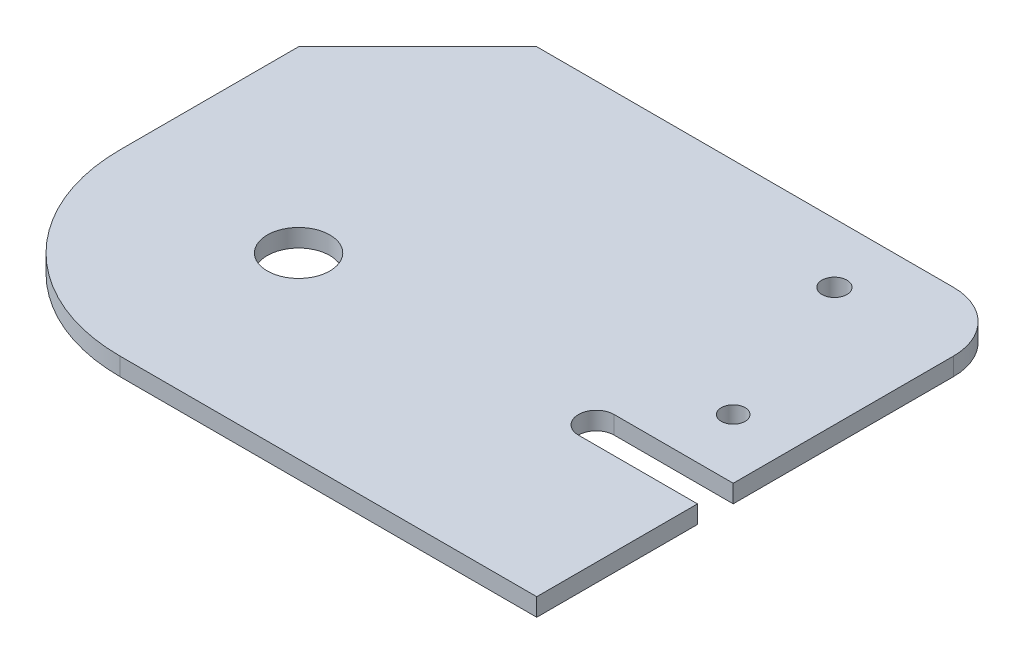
ISO-10303-21;
HEADER;
FILE_DESCRIPTION(('STEP AP214'),'2;1');
FILE_NAME('part.step','',(''),(''),'','','');
FILE_SCHEMA(('AUTOMOTIVE_DESIGN { 1 0 10303 214 1 1 1 1 }'));
ENDSEC;
DATA;
#1=APPLICATION_CONTEXT('core data for automotive mechanical design processes');
#2=APPLICATION_PROTOCOL_DEFINITION('international standard','automotive_design',2000,#1);
#3=PRODUCT_CONTEXT('',#1,'mechanical');
#4=PRODUCT('Part','Part','',(#3));
#5=PRODUCT_RELATED_PRODUCT_CATEGORY('part','',(#4));
#6=PRODUCT_DEFINITION_FORMATION('','',#4);
#7=PRODUCT_DEFINITION_CONTEXT('part definition',#1,'design');
#8=PRODUCT_DEFINITION('design','',#6,#7);
#9=PRODUCT_DEFINITION_SHAPE('','',#8);
#10=(LENGTH_UNIT() NAMED_UNIT(*) SI_UNIT(.MILLI.,.METRE.));
#11=(NAMED_UNIT(*) PLANE_ANGLE_UNIT() SI_UNIT($,.RADIAN.));
#12=(NAMED_UNIT(*) SI_UNIT($,.STERADIAN.) SOLID_ANGLE_UNIT());
#13=UNCERTAINTY_MEASURE_WITH_UNIT(LENGTH_MEASURE(1.E-05),#10,'distance_accuracy_value','');
#14=(GEOMETRIC_REPRESENTATION_CONTEXT(3) GLOBAL_UNCERTAINTY_ASSIGNED_CONTEXT((#13)) GLOBAL_UNIT_ASSIGNED_CONTEXT((#10,
#11,#12)) REPRESENTATION_CONTEXT('',''));
#15=CARTESIAN_POINT('',(0.,0.,0.));
#16=DIRECTION('',(0.,0.,1.));
#17=DIRECTION('',(1.,0.,0.));
#18=AXIS2_PLACEMENT_3D('',#15,#16,#17);
#19=CARTESIAN_POINT('',(30.,0.,-30.));
#20=DIRECTION('',(0.,-1.,0.));
#21=DIRECTION('',(0.,0.,-1.));
#22=AXIS2_PLACEMENT_3D('',#19,#20,#21);
#23=PLANE('',#22);
#24=CARTESIAN_POINT('',(90.,0.,-43.));
#25=DIRECTION('',(0.,1.,0.));
#26=DIRECTION('',(0.,0.,1.));
#27=AXIS2_PLACEMENT_3D('',#24,#25,#26);
#28=CIRCLE('',#27,2.);
#29=CARTESIAN_POINT('',(90.,0.,-41.));
#30=VERTEX_POINT('',#29);
#31=EDGE_CURVE('E268',#30,#30,#28,.T.);
#32=ORIENTED_EDGE('',*,*,#31,.T.);
#33=EDGE_LOOP('',(#32));
#34=FACE_BOUND('',#33,.T.);
#35=CARTESIAN_POINT('',(30.,0.,-30.));
#36=DIRECTION('',(0.,1.,0.));
#37=DIRECTION('',(0.,0.,-1.));
#38=AXIS2_PLACEMENT_3D('',#35,#36,#37);
#39=CIRCLE('',#38,30.);
#40=CARTESIAN_POINT('',(0.,0.,-30.0000000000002));
#41=VERTEX_POINT('',#40);
#42=CARTESIAN_POINT('',(30.0000000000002,0.,0.));
#43=VERTEX_POINT('',#42);
#44=EDGE_CURVE('E147',#41,#43,#39,.T.);
#45=ORIENTED_EDGE('',*,*,#44,.F.);
#46=DIRECTION('',(0.,0.,1.));
#47=VECTOR('',#46,1.);
#48=CARTESIAN_POINT('',(0.,0.,-30.0000000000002));
#49=LINE('',#48,#47);
#50=CARTESIAN_POINT('',(0.,0.,-60.));
#51=VERTEX_POINT('',#50);
#52=EDGE_CURVE('E92',#51,#41,#49,.T.);
#53=ORIENTED_EDGE('',*,*,#52,.F.);
#54=DIRECTION('',(-0.707106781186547,0.,0.707106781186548));
#55=VECTOR('',#54,1.);
#56=CARTESIAN_POINT('',(20.,0.,-80.));
#57=LINE('',#56,#55);
#58=CARTESIAN_POINT('',(20.,0.,-80.));
#59=VERTEX_POINT('',#58);
#60=EDGE_CURVE('E86',#59,#51,#57,.T.);
#61=ORIENTED_EDGE('',*,*,#60,.F.);
#62=DIRECTION('',(-1.,0.,0.));
#63=VECTOR('',#62,1.);
#64=CARTESIAN_POINT('',(20.,0.,-80.));
#65=LINE('',#64,#63);
#66=CARTESIAN_POINT('',(90.,0.,-80.));
#67=VERTEX_POINT('',#66);
#68=EDGE_CURVE('E137',#67,#59,#65,.T.);
#69=ORIENTED_EDGE('',*,*,#68,.F.);
#70=CARTESIAN_POINT('',(90.,0.,-70.));
#71=DIRECTION('',(0.,1.,0.));
#72=DIRECTION('',(0.,0.,1.));
#73=AXIS2_PLACEMENT_3D('',#70,#71,#72);
#74=CIRCLE('',#73,9.99999999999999);
#75=CARTESIAN_POINT('',(100.,0.,-70.));
#76=VERTEX_POINT('',#75);
#77=EDGE_CURVE('E163',#76,#67,#74,.T.);
#78=ORIENTED_EDGE('',*,*,#77,.F.);
#79=DIRECTION('',(0.,0.,-1.));
#80=VECTOR('',#79,1.);
#81=CARTESIAN_POINT('',(100.,0.,-33.));
#82=LINE('',#81,#80);
#83=CARTESIAN_POINT('',(100.,0.,-33.));
#84=VERTEX_POINT('',#83);
#85=EDGE_CURVE('E161',#84,#76,#82,.T.);
#86=ORIENTED_EDGE('',*,*,#85,.F.);
#87=DIRECTION('',(1.,0.,0.));
#88=VECTOR('',#87,1.);
#89=CARTESIAN_POINT('',(80.,0.,-33.));
#90=LINE('',#89,#88);
#91=CARTESIAN_POINT('',(80.,0.,-33.));
#92=VERTEX_POINT('',#91);
#93=EDGE_CURVE('E159',#92,#84,#90,.T.);
#94=ORIENTED_EDGE('',*,*,#93,.F.);
#95=CARTESIAN_POINT('',(80.,0.,-30.));
#96=DIRECTION('',(0.,-1.,0.));
#97=DIRECTION('',(0.,0.,1.));
#98=AXIS2_PLACEMENT_3D('',#95,#96,#97);
#99=CIRCLE('',#98,3.);
#100=CARTESIAN_POINT('',(80.,0.,-27.));
#101=VERTEX_POINT('',#100);
#102=EDGE_CURVE('E157',#101,#92,#99,.T.);
#103=ORIENTED_EDGE('',*,*,#102,.F.);
#104=DIRECTION('',(-1.,0.,0.));
#105=VECTOR('',#104,1.);
#106=CARTESIAN_POINT('',(80.,0.,-27.));
#107=LINE('',#106,#105);
#108=CARTESIAN_POINT('',(100.,0.,-27.));
#109=VERTEX_POINT('',#108);
#110=EDGE_CURVE('E155',#109,#101,#107,.T.);
#111=ORIENTED_EDGE('',*,*,#110,.F.);
#112=DIRECTION('',(0.,0.,-1.));
#113=VECTOR('',#112,1.);
#114=CARTESIAN_POINT('',(100.,0.,0.));
#115=LINE('',#114,#113);
#116=CARTESIAN_POINT('',(100.,0.,0.));
#117=VERTEX_POINT('',#116);
#118=EDGE_CURVE('E153',#117,#109,#115,.T.);
#119=ORIENTED_EDGE('',*,*,#118,.F.);
#120=DIRECTION('',(1.,0.,0.));
#121=VECTOR('',#120,1.);
#122=CARTESIAN_POINT('',(30.0000000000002,0.,0.));
#123=LINE('',#122,#121);
#124=EDGE_CURVE('E150',#43,#117,#123,.T.);
#125=ORIENTED_EDGE('',*,*,#124,.F.);
#126=EDGE_LOOP('',(#45,#53,#61,#69,#78,#86,#94,#103,#111,#119,#125));
#127=FACE_BOUND('',#126,.T.);
#128=CARTESIAN_POINT('',(30.,0.,-30.));
#129=DIRECTION('',(0.,1.,0.));
#130=DIRECTION('',(0.,0.,1.));
#131=AXIS2_PLACEMENT_3D('',#128,#129,#130);
#132=CIRCLE('',#131,5.25);
#133=CARTESIAN_POINT('',(30.,0.,-24.75));
#134=VERTEX_POINT('',#133);
#135=EDGE_CURVE('E274',#134,#134,#132,.T.);
#136=ORIENTED_EDGE('',*,*,#135,.T.);
#137=EDGE_LOOP('',(#136));
#138=FACE_BOUND('',#137,.T.);
#139=CARTESIAN_POINT('',(80.,0.,-70.));
#140=DIRECTION('',(0.,1.,0.));
#141=DIRECTION('',(0.,0.,1.));
#142=AXIS2_PLACEMENT_3D('',#139,#140,#141);
#143=CIRCLE('',#142,2.1);
#144=CARTESIAN_POINT('',(80.,0.,-67.9));
#145=VERTEX_POINT('',#144);
#146=EDGE_CURVE('E262',#145,#145,#143,.T.);
#147=ORIENTED_EDGE('',*,*,#146,.T.);
#148=EDGE_LOOP('',(#147));
#149=FACE_BOUND('',#148,.T.);
#150=ADVANCED_FACE('F31',(#34,#127,#138,#149),#23,.T.);
#151=CARTESIAN_POINT('',(30.,3.,-30.));
#152=DIRECTION('',(0.,-1.,0.));
#153=DIRECTION('',(0.,0.,-1.));
#154=AXIS2_PLACEMENT_3D('',#151,#152,#153);
#155=PLANE('',#154);
#156=CARTESIAN_POINT('',(90.,3.,-43.));
#157=DIRECTION('',(0.,1.,0.));
#158=DIRECTION('',(0.,0.,1.));
#159=AXIS2_PLACEMENT_3D('',#156,#157,#158);
#160=CIRCLE('',#159,2.);
#161=CARTESIAN_POINT('',(90.,3.,-41.));
#162=VERTEX_POINT('',#161);
#163=EDGE_CURVE('E271',#162,#162,#160,.T.);
#164=ORIENTED_EDGE('',*,*,#163,.F.);
#165=EDGE_LOOP('',(#164));
#166=FACE_BOUND('',#165,.T.);
#167=CARTESIAN_POINT('',(30.,3.,-30.));
#168=DIRECTION('',(0.,1.,0.));
#169=DIRECTION('',(0.,0.,-1.));
#170=AXIS2_PLACEMENT_3D('',#167,#168,#169);
#171=CIRCLE('',#170,30.);
#172=CARTESIAN_POINT('',(0.,3.,-30.0000000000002));
#173=VERTEX_POINT('',#172);
#174=CARTESIAN_POINT('',(30.0000000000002,3.,0.));
#175=VERTEX_POINT('',#174);
#176=EDGE_CURVE('E168',#173,#175,#171,.T.);
#177=ORIENTED_EDGE('',*,*,#176,.T.);
#178=DIRECTION('',(1.,0.,0.));
#179=VECTOR('',#178,1.);
#180=CARTESIAN_POINT('',(30.0000000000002,3.,0.));
#181=LINE('',#180,#179);
#182=CARTESIAN_POINT('',(100.,3.,0.));
#183=VERTEX_POINT('',#182);
#184=EDGE_CURVE('E100',#175,#183,#181,.T.);
#185=ORIENTED_EDGE('',*,*,#184,.T.);
#186=DIRECTION('',(0.,0.,-1.));
#187=VECTOR('',#186,1.);
#188=CARTESIAN_POINT('',(100.,3.,0.));
#189=LINE('',#188,#187);
#190=CARTESIAN_POINT('',(100.,3.,-27.));
#191=VERTEX_POINT('',#190);
#192=EDGE_CURVE('E192',#183,#191,#189,.T.);
#193=ORIENTED_EDGE('',*,*,#192,.T.);
#194=DIRECTION('',(-1.,0.,0.));
#195=VECTOR('',#194,1.);
#196=CARTESIAN_POINT('',(80.,3.,-27.));
#197=LINE('',#196,#195);
#198=CARTESIAN_POINT('',(80.,3.,-27.));
#199=VERTEX_POINT('',#198);
#200=EDGE_CURVE('E210',#191,#199,#197,.T.);
#201=ORIENTED_EDGE('',*,*,#200,.T.);
#202=CARTESIAN_POINT('',(80.,3.,-30.));
#203=DIRECTION('',(0.,-1.,0.));
#204=DIRECTION('',(0.,0.,1.));
#205=AXIS2_PLACEMENT_3D('',#202,#203,#204);
#206=CIRCLE('',#205,3.);
#207=CARTESIAN_POINT('',(80.,3.,-33.));
#208=VERTEX_POINT('',#207);
#209=EDGE_CURVE('E207',#199,#208,#206,.T.);
#210=ORIENTED_EDGE('',*,*,#209,.T.);
#211=DIRECTION('',(1.,0.,0.));
#212=VECTOR('',#211,1.);
#213=CARTESIAN_POINT('',(80.,3.,-33.));
#214=LINE('',#213,#212);
#215=CARTESIAN_POINT('',(100.,3.,-33.));
#216=VERTEX_POINT('',#215);
#217=EDGE_CURVE('E209',#208,#216,#214,.T.);
#218=ORIENTED_EDGE('',*,*,#217,.T.);
#219=DIRECTION('',(0.,0.,-1.));
#220=VECTOR('',#219,1.);
#221=CARTESIAN_POINT('',(100.,3.,-33.));
#222=LINE('',#221,#220);
#223=CARTESIAN_POINT('',(100.,3.,-70.));
#224=VERTEX_POINT('',#223);
#225=EDGE_CURVE('E212',#216,#224,#222,.T.);
#226=ORIENTED_EDGE('',*,*,#225,.T.);
#227=CARTESIAN_POINT('',(90.,3.,-70.));
#228=DIRECTION('',(0.,1.,0.));
#229=DIRECTION('',(0.,0.,1.));
#230=AXIS2_PLACEMENT_3D('',#227,#228,#229);
#231=CIRCLE('',#230,9.99999999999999);
#232=CARTESIAN_POINT('',(90.,3.,-80.));
#233=VERTEX_POINT('',#232);
#234=EDGE_CURVE('E129',#224,#233,#231,.T.);
#235=ORIENTED_EDGE('',*,*,#234,.T.);
#236=DIRECTION('',(-1.,0.,0.));
#237=VECTOR('',#236,1.);
#238=CARTESIAN_POINT('',(20.,3.,-80.));
#239=LINE('',#238,#237);
#240=CARTESIAN_POINT('',(20.,3.,-80.));
#241=VERTEX_POINT('',#240);
#242=EDGE_CURVE('E122',#233,#241,#239,.T.);
#243=ORIENTED_EDGE('',*,*,#242,.T.);
#244=DIRECTION('',(-0.707106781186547,0.,0.707106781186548));
#245=VECTOR('',#244,1.);
#246=CARTESIAN_POINT('',(20.,3.,-80.));
#247=LINE('',#246,#245);
#248=CARTESIAN_POINT('',(0.,3.,-60.));
#249=VERTEX_POINT('',#248);
#250=EDGE_CURVE('E127',#241,#249,#247,.T.);
#251=ORIENTED_EDGE('',*,*,#250,.T.);
#252=DIRECTION('',(0.,0.,1.));
#253=VECTOR('',#252,1.);
#254=CARTESIAN_POINT('',(0.,3.,-30.0000000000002));
#255=LINE('',#254,#253);
#256=EDGE_CURVE('E48',#249,#173,#255,.T.);
#257=ORIENTED_EDGE('',*,*,#256,.T.);
#258=EDGE_LOOP('',(#177,#185,#193,#201,#210,#218,#226,#235,#243,#251,#257));
#259=FACE_BOUND('',#258,.T.);
#260=CARTESIAN_POINT('',(30.,3.,-30.));
#261=DIRECTION('',(0.,1.,0.));
#262=DIRECTION('',(0.,0.,1.));
#263=AXIS2_PLACEMENT_3D('',#260,#261,#262);
#264=CIRCLE('',#263,5.25);
#265=CARTESIAN_POINT('',(30.,3.,-24.75));
#266=VERTEX_POINT('',#265);
#267=EDGE_CURVE('E151',#266,#266,#264,.T.);
#268=ORIENTED_EDGE('',*,*,#267,.F.);
#269=EDGE_LOOP('',(#268));
#270=FACE_BOUND('',#269,.T.);
#271=CARTESIAN_POINT('',(80.,3.,-70.));
#272=DIRECTION('',(0.,1.,0.));
#273=DIRECTION('',(0.,0.,1.));
#274=AXIS2_PLACEMENT_3D('',#271,#272,#273);
#275=CIRCLE('',#274,2.09999999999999);
#276=CARTESIAN_POINT('',(80.,3.,-67.9));
#277=VERTEX_POINT('',#276);
#278=EDGE_CURVE('E265',#277,#277,#275,.T.);
#279=ORIENTED_EDGE('',*,*,#278,.F.);
#280=EDGE_LOOP('',(#279));
#281=FACE_BOUND('',#280,.T.);
#282=ADVANCED_FACE('F124',(#166,#259,#270,#281),#155,.F.);
#283=CARTESIAN_POINT('',(30.,3.,-30.));
#284=DIRECTION('',(0.,-1.,0.));
#285=DIRECTION('',(0.,0.,-1.));
#286=AXIS2_PLACEMENT_3D('',#283,#284,#285);
#287=CYLINDRICAL_SURFACE('',#286,30.);
#288=ORIENTED_EDGE('',*,*,#44,.T.);
#289=DIRECTION('',(0.,-1.,0.));
#290=VECTOR('',#289,1.);
#291=CARTESIAN_POINT('',(30.0000000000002,3.,0.));
#292=LINE('',#291,#290);
#293=EDGE_CURVE('E11',#175,#43,#292,.T.);
#294=ORIENTED_EDGE('',*,*,#293,.F.);
#295=ORIENTED_EDGE('',*,*,#176,.F.);
#296=DIRECTION('',(0.,-1.,0.));
#297=VECTOR('',#296,1.);
#298=CARTESIAN_POINT('',(0.,3.,-30.0000000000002));
#299=LINE('',#298,#297);
#300=EDGE_CURVE('E143',#173,#41,#299,.T.);
#301=ORIENTED_EDGE('',*,*,#300,.T.);
#302=EDGE_LOOP('',(#288,#294,#295,#301));
#303=FACE_BOUND('',#302,.T.);
#304=ADVANCED_FACE('F33',(#303),#287,.T.);
#305=CARTESIAN_POINT('',(30.0000000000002,3.,0.));
#306=DIRECTION('',(0.,0.,-1.));
#307=DIRECTION('',(-1.,0.,0.));
#308=AXIS2_PLACEMENT_3D('',#305,#306,#307);
#309=PLANE('',#308);
#310=ORIENTED_EDGE('',*,*,#124,.T.);
#311=DIRECTION('',(0.,-1.,0.));
#312=VECTOR('',#311,1.);
#313=CARTESIAN_POINT('',(100.,3.,0.));
#314=LINE('',#313,#312);
#315=EDGE_CURVE('E40',#183,#117,#314,.T.);
#316=ORIENTED_EDGE('',*,*,#315,.F.);
#317=ORIENTED_EDGE('',*,*,#184,.F.);
#318=ORIENTED_EDGE('',*,*,#293,.T.);
#319=EDGE_LOOP('',(#310,#316,#317,#318));
#320=FACE_BOUND('',#319,.T.);
#321=ADVANCED_FACE('F366',(#320),#309,.F.);
#322=CARTESIAN_POINT('',(100.,3.,0.));
#323=DIRECTION('',(-1.,0.,0.));
#324=DIRECTION('',(0.,0.,1.));
#325=AXIS2_PLACEMENT_3D('',#322,#323,#324);
#326=PLANE('',#325);
#327=ORIENTED_EDGE('',*,*,#118,.T.);
#328=DIRECTION('',(0.,-1.,0.));
#329=VECTOR('',#328,1.);
#330=CARTESIAN_POINT('',(100.,3.,-27.));
#331=LINE('',#330,#329);
#332=EDGE_CURVE('E184',#191,#109,#331,.T.);
#333=ORIENTED_EDGE('',*,*,#332,.F.);
#334=ORIENTED_EDGE('',*,*,#192,.F.);
#335=ORIENTED_EDGE('',*,*,#315,.T.);
#336=EDGE_LOOP('',(#327,#333,#334,#335));
#337=FACE_BOUND('',#336,.T.);
#338=ADVANCED_FACE('F190',(#337),#326,.F.);
#339=CARTESIAN_POINT('',(80.,3.,-27.));
#340=DIRECTION('',(0.,0.,1.));
#341=DIRECTION('',(1.,0.,0.));
#342=AXIS2_PLACEMENT_3D('',#339,#340,#341);
#343=PLANE('',#342);
#344=ORIENTED_EDGE('',*,*,#110,.T.);
#345=DIRECTION('',(0.,-1.,0.));
#346=VECTOR('',#345,1.);
#347=CARTESIAN_POINT('',(80.,3.,-27.));
#348=LINE('',#347,#346);
#349=EDGE_CURVE('E181',#199,#101,#348,.T.);
#350=ORIENTED_EDGE('',*,*,#349,.F.);
#351=ORIENTED_EDGE('',*,*,#200,.F.);
#352=ORIENTED_EDGE('',*,*,#332,.T.);
#353=EDGE_LOOP('',(#344,#350,#351,#352));
#354=FACE_BOUND('',#353,.T.);
#355=ADVANCED_FACE('F201',(#354),#343,.F.);
#356=CARTESIAN_POINT('',(80.,3.,-30.));
#357=DIRECTION('',(0.,-1.,0.));
#358=DIRECTION('',(0.,0.,-1.));
#359=AXIS2_PLACEMENT_3D('',#356,#357,#358);
#360=CYLINDRICAL_SURFACE('',#359,3.);
#361=ORIENTED_EDGE('',*,*,#102,.T.);
#362=DIRECTION('',(0.,-1.,0.));
#363=VECTOR('',#362,1.);
#364=CARTESIAN_POINT('',(80.,3.,-33.));
#365=LINE('',#364,#363);
#366=EDGE_CURVE('E178',#208,#92,#365,.T.);
#367=ORIENTED_EDGE('',*,*,#366,.F.);
#368=ORIENTED_EDGE('',*,*,#209,.F.);
#369=ORIENTED_EDGE('',*,*,#349,.T.);
#370=EDGE_LOOP('',(#361,#367,#368,#369));
#371=FACE_BOUND('',#370,.T.);
#372=ADVANCED_FACE('F205',(#371),#360,.F.);
#373=CARTESIAN_POINT('',(80.,3.,-33.));
#374=DIRECTION('',(0.,0.,-1.));
#375=DIRECTION('',(-1.,0.,0.));
#376=AXIS2_PLACEMENT_3D('',#373,#374,#375);
#377=PLANE('',#376);
#378=ORIENTED_EDGE('',*,*,#93,.T.);
#379=DIRECTION('',(0.,-1.,0.));
#380=VECTOR('',#379,1.);
#381=CARTESIAN_POINT('',(100.,3.,-33.));
#382=LINE('',#381,#380);
#383=EDGE_CURVE('E175',#216,#84,#382,.T.);
#384=ORIENTED_EDGE('',*,*,#383,.F.);
#385=ORIENTED_EDGE('',*,*,#217,.F.);
#386=ORIENTED_EDGE('',*,*,#366,.T.);
#387=EDGE_LOOP('',(#378,#384,#385,#386));
#388=FACE_BOUND('',#387,.T.);
#389=ADVANCED_FACE('F332',(#388),#377,.F.);
#390=CARTESIAN_POINT('',(100.,3.,-33.));
#391=DIRECTION('',(-1.,0.,0.));
#392=DIRECTION('',(0.,0.,1.));
#393=AXIS2_PLACEMENT_3D('',#390,#391,#392);
#394=PLANE('',#393);
#395=ORIENTED_EDGE('',*,*,#85,.T.);
#396=DIRECTION('',(0.,-1.,0.));
#397=VECTOR('',#396,1.);
#398=CARTESIAN_POINT('',(100.,3.,-70.));
#399=LINE('',#398,#397);
#400=EDGE_CURVE('E172',#224,#76,#399,.T.);
#401=ORIENTED_EDGE('',*,*,#400,.F.);
#402=ORIENTED_EDGE('',*,*,#225,.F.);
#403=ORIENTED_EDGE('',*,*,#383,.T.);
#404=EDGE_LOOP('',(#395,#401,#402,#403));
#405=FACE_BOUND('',#404,.T.);
#406=ADVANCED_FACE('F221',(#405),#394,.F.);
#407=CARTESIAN_POINT('',(90.,3.,-70.));
#408=DIRECTION('',(0.,-1.,0.));
#409=DIRECTION('',(0.,0.,-1.));
#410=AXIS2_PLACEMENT_3D('',#407,#408,#409);
#411=CYLINDRICAL_SURFACE('',#410,9.99999999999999);
#412=ORIENTED_EDGE('',*,*,#77,.T.);
#413=DIRECTION('',(0.,-1.,0.));
#414=VECTOR('',#413,1.);
#415=CARTESIAN_POINT('',(90.,3.,-80.));
#416=LINE('',#415,#414);
#417=EDGE_CURVE('E138',#233,#67,#416,.T.);
#418=ORIENTED_EDGE('',*,*,#417,.F.);
#419=ORIENTED_EDGE('',*,*,#234,.F.);
#420=ORIENTED_EDGE('',*,*,#400,.T.);
#421=EDGE_LOOP('',(#412,#418,#419,#420));
#422=FACE_BOUND('',#421,.T.);
#423=ADVANCED_FACE('F225',(#422),#411,.T.);
#424=CARTESIAN_POINT('',(20.,3.,-80.));
#425=DIRECTION('',(0.,0.,1.));
#426=DIRECTION('',(1.,0.,0.));
#427=AXIS2_PLACEMENT_3D('',#424,#425,#426);
#428=PLANE('',#427);
#429=ORIENTED_EDGE('',*,*,#68,.T.);
#430=DIRECTION('',(0.,-1.,0.));
#431=VECTOR('',#430,1.);
#432=CARTESIAN_POINT('',(20.,3.,-80.));
#433=LINE('',#432,#431);
#434=EDGE_CURVE('E134',#241,#59,#433,.T.);
#435=ORIENTED_EDGE('',*,*,#434,.F.);
#436=ORIENTED_EDGE('',*,*,#242,.F.);
#437=ORIENTED_EDGE('',*,*,#417,.T.);
#438=EDGE_LOOP('',(#429,#435,#436,#437));
#439=FACE_BOUND('',#438,.T.);
#440=ADVANCED_FACE('F135',(#439),#428,.F.);
#441=CARTESIAN_POINT('',(20.,3.,-80.));
#442=DIRECTION('',(0.707106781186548,0.,0.707106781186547));
#443=DIRECTION('',(0.707106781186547,0.,-0.707106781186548));
#444=AXIS2_PLACEMENT_3D('',#441,#442,#443);
#445=PLANE('',#444);
#446=ORIENTED_EDGE('',*,*,#60,.T.);
#447=DIRECTION('',(0.,-1.,0.));
#448=VECTOR('',#447,1.);
#449=CARTESIAN_POINT('',(0.,3.,-60.));
#450=LINE('',#449,#448);
#451=EDGE_CURVE('E139',#249,#51,#450,.T.);
#452=ORIENTED_EDGE('',*,*,#451,.F.);
#453=ORIENTED_EDGE('',*,*,#250,.F.);
#454=ORIENTED_EDGE('',*,*,#434,.T.);
#455=EDGE_LOOP('',(#446,#452,#453,#454));
#456=FACE_BOUND('',#455,.T.);
#457=ADVANCED_FACE('F141',(#456),#445,.F.);
#458=CARTESIAN_POINT('',(0.,3.,-30.0000000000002));
#459=DIRECTION('',(1.,0.,0.));
#460=DIRECTION('',(0.,0.,-1.));
#461=AXIS2_PLACEMENT_3D('',#458,#459,#460);
#462=PLANE('',#461);
#463=ORIENTED_EDGE('',*,*,#52,.T.);
#464=ORIENTED_EDGE('',*,*,#300,.F.);
#465=ORIENTED_EDGE('',*,*,#256,.F.);
#466=ORIENTED_EDGE('',*,*,#451,.T.);
#467=EDGE_LOOP('',(#463,#464,#465,#466));
#468=FACE_BOUND('',#467,.T.);
#469=ADVANCED_FACE('F229',(#468),#462,.F.);
#470=CARTESIAN_POINT('',(30.,3.,-30.));
#471=DIRECTION('',(0.,-1.,0.));
#472=DIRECTION('',(0.,0.,-1.));
#473=AXIS2_PLACEMENT_3D('',#470,#471,#472);
#474=CYLINDRICAL_SURFACE('',#473,5.25);
#475=ORIENTED_EDGE('',*,*,#267,.T.);
#476=EDGE_LOOP('',(#475));
#477=FACE_BOUND('',#476,.T.);
#478=ORIENTED_EDGE('',*,*,#135,.F.);
#479=EDGE_LOOP('',(#478));
#480=FACE_BOUND('',#479,.T.);
#481=ADVANCED_FACE('F231',(#477,#480),#474,.F.);
#482=CARTESIAN_POINT('',(90.,3.,-43.));
#483=DIRECTION('',(0.,-1.,0.));
#484=DIRECTION('',(0.,0.,-1.));
#485=AXIS2_PLACEMENT_3D('',#482,#483,#484);
#486=CYLINDRICAL_SURFACE('',#485,2.);
#487=ORIENTED_EDGE('',*,*,#163,.T.);
#488=EDGE_LOOP('',(#487));
#489=FACE_BOUND('',#488,.T.);
#490=ORIENTED_EDGE('',*,*,#31,.F.);
#491=EDGE_LOOP('',(#490));
#492=FACE_BOUND('',#491,.T.);
#493=ADVANCED_FACE('F237',(#489,#492),#486,.F.);
#494=CARTESIAN_POINT('',(80.,3.,-70.));
#495=DIRECTION('',(0.,1.,0.));
#496=DIRECTION('',(0.,0.,1.));
#497=AXIS2_PLACEMENT_3D('',#494,#495,#496);
#498=CYLINDRICAL_SURFACE('',#497,2.1);
#499=ORIENTED_EDGE('',*,*,#146,.F.);
#500=EDGE_LOOP('',(#499));
#501=FACE_BOUND('',#500,.T.);
#502=ORIENTED_EDGE('',*,*,#278,.T.);
#503=EDGE_LOOP('',(#502));
#504=FACE_BOUND('',#503,.T.);
#505=ADVANCED_FACE('F253',(#501,#504),#498,.F.);
#506=CLOSED_SHELL('',(#150,#282,#304,#321,#338,#355,#372,#389,#406,#423,#440,#457,#469,#481,
#493,#505));
#507=MANIFOLD_SOLID_BREP('B2',#506);
#508=ADVANCED_BREP_SHAPE_REPRESENTATION('',(#18,#507),#14);
#509=SHAPE_DEFINITION_REPRESENTATION(#9,#508);
ENDSEC;
END-ISO-10303-21;
